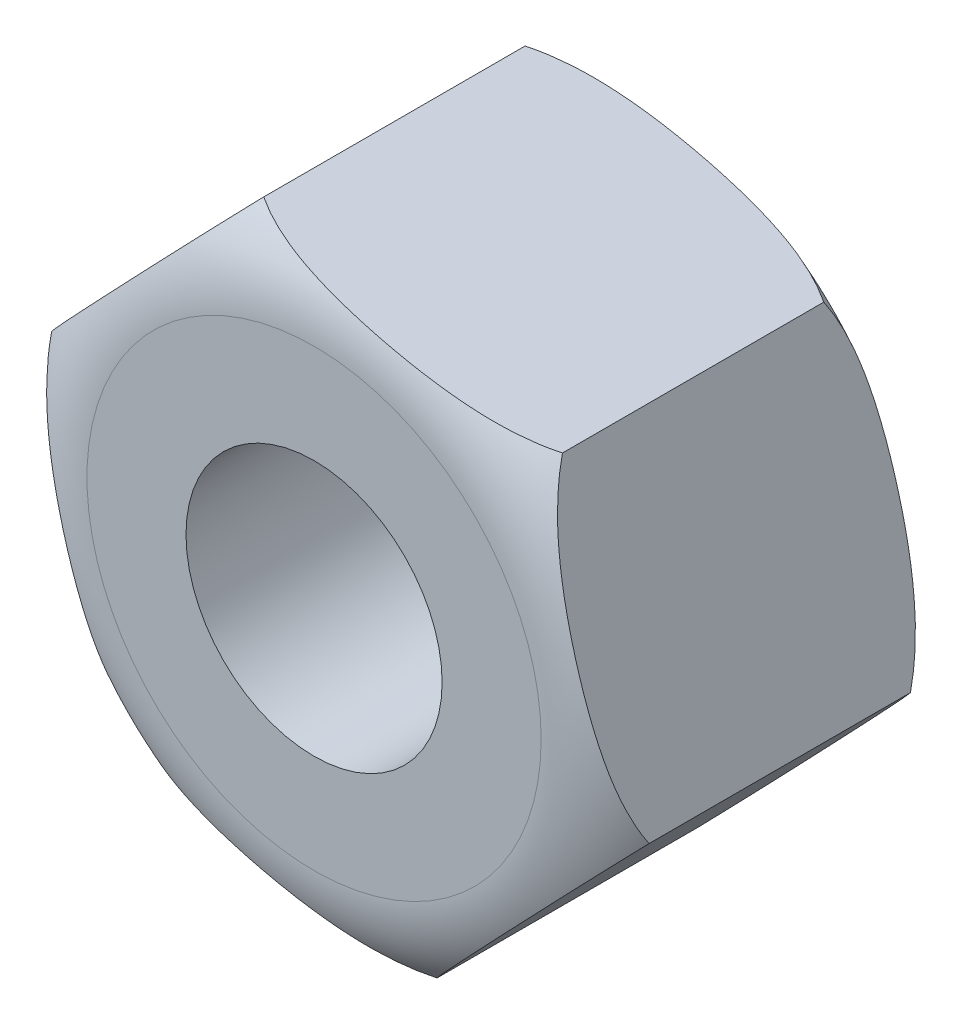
from build123d import *

# Parameters (mm, degrees)
SKETCH1_R               = 25
BOSS_EXTRUDE1_DEPTH     = 25
FILLET1_R               = 8
CUT_EXTRUDE2_DEPTH      = 10
CUT_EXTRUDE2_DEPTH_BACK = 25
SKETCH2_OUTSIDE_W       = 67
SKETCH2_OUTSIDE_H       = 67
SKETCH2_OUTSIDE_R       = 9.586124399


with BuildPart() as part:
    # Sketch1 → Boss-Extrude1 (new body)
    with BuildSketch(Plane.XY):
        Circle(SKETCH1_R)
    extrude(amount=BOSS_EXTRUDE1_DEPTH)

    # Fillet1
    fillet1_edges = [part.edges().sort_by_distance(p)[0] for p in [
        (-25, 0, 0),
        (-25, 0, 25),
    ]]
    fillet(fillet1_edges, radius=FILLET1_R)

    # Sketch2 outside → Cut-Extrude2 (cut, two sides: drawn at the far end of the back side and taken through both)
    # profile 1 of 2: a face of its own
    with BuildSketch(Plane(origin=(0, 0, 0), x_dir=(-1, 0, 0), z_dir=(0, 0, -1)).offset(-CUT_EXTRUDE2_DEPTH_BACK)):
        Rectangle(SKETCH2_OUTSIDE_W, SKETCH2_OUTSIDE_H)
        Polygon((22.361208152, 5.421733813), (6.485244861, 22.076241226), (-15.875963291, 16.654507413), (-22.361208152, -5.421733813), (-6.485244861, -22.076241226), (15.875963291, -16.654507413), align=None, mode=Mode.SUBTRACT)
    # profile 2 of 2: a face of its own
    with BuildSketch(Plane(origin=(0, 0, 0), x_dir=(-1, 0, 0), z_dir=(0, 0, -1)).offset(-CUT_EXTRUDE2_DEPTH_BACK)):
        with Locations(Location((0, 0, 0), (0, 0, 180))):
            Circle(SKETCH2_OUTSIDE_R)
    extrude(amount=CUT_EXTRUDE2_DEPTH + CUT_EXTRUDE2_DEPTH_BACK, mode=Mode.SUBTRACT)


solid = part.part
